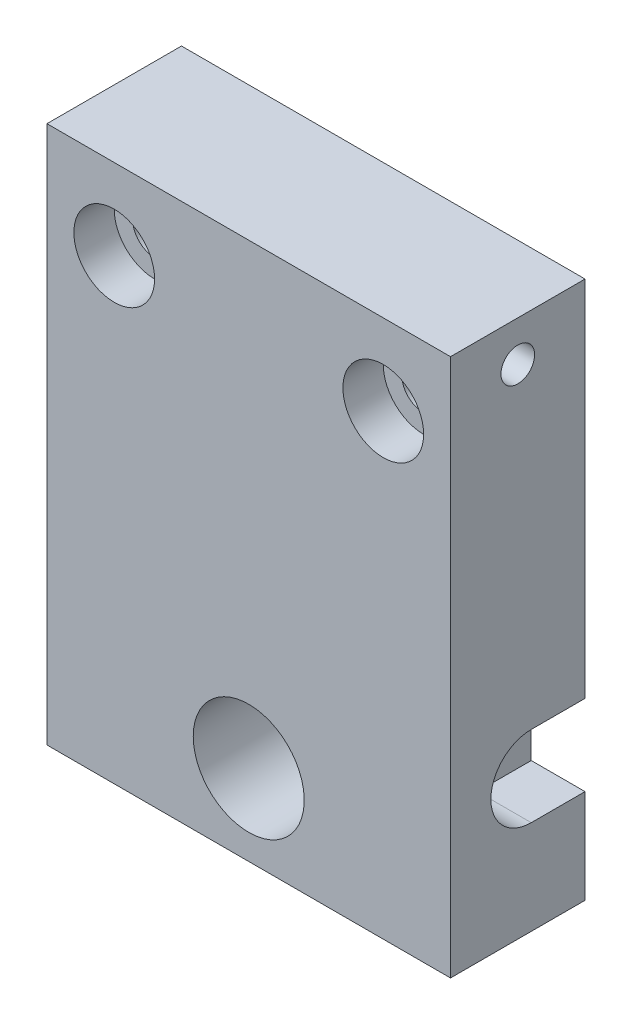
from build123d import *

# Parameters (mm, degrees)
ESQUISSE1_W                             = 60
ESQUISSE1_H                             = 20
EXTRUSION1_DEPTH                        = 80
CHAMBRAGE_POUR_AXES_6_5_MM3_D           = 6.5
CHAMBRAGE_POUR_AXES_6_5_MM3_CBORE_D     = 12
CHAMBRAGE_POUR_AXES_6_5_MM3_CBORE_DEPTH = 6
TROU_TARAUD_M61_D                       = 5
TROU_TARAUD_M61_DEPTH                   = 16
TROU_TARAUD_M61_TIP                     = 1.502151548
TROU_TARAUD_M62_D                       = 5
TROU_TARAUD_M62_DEPTH                   = 16
TROU_TARAUD_M62_TIP                     = 1.502151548
ENL_V_MAT_EXTRU_1_DEPTH                 = 8
TROU_TARAUD_M18X1_51_D                  = 16.5
TROU_TARAUD_M18X1_51_DEPTH              = 43.5
TROU_TARAUD_M18X1_51_TIP                = 4.957100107


with BuildPart() as part:
    # Esquisse1 → Extrusion1 (new body)
    with BuildSketch(Plane(origin=(0, 0, 0), x_dir=(1, 0, 0), z_dir=(0, 1, 0))):
        with Locations((0, 10)):
            Rectangle(ESQUISSE1_W, ESQUISSE1_H)
    extrude(amount=EXTRUSION1_DEPTH)

    # Chambrage pour axes 6.5 mm3 (through all)
    with Locations(Plane.XY):
        with Locations((-20, 68), (20, 68)):
            CounterBoreHole(CHAMBRAGE_POUR_AXES_6_5_MM3_D / 2, CHAMBRAGE_POUR_AXES_6_5_MM3_CBORE_D / 2, CHAMBRAGE_POUR_AXES_6_5_MM3_CBORE_DEPTH)

    # Trou taraud_ M61
    with Locations(Plane(origin=(30, 0, 0), x_dir=(0, 0, -1), z_dir=(1, 0, 0))):
        with Locations((10, 74)):
            Hole(TROU_TARAUD_M61_D / 2, depth=TROU_TARAUD_M61_DEPTH)
            with Locations((0, 0, -(TROU_TARAUD_M61_DEPTH + TROU_TARAUD_M61_TIP / 2))):  # 118° drill point
                Cone(0, TROU_TARAUD_M61_D / 2, TROU_TARAUD_M61_TIP, mode=Mode.SUBTRACT)

    # Trou taraud_ M62
    with Locations(Plane.ZY.offset(30)):
        with Locations((-10, 74)):
            Hole(TROU_TARAUD_M62_D / 2, depth=TROU_TARAUD_M62_DEPTH)
            with Locations((0, 0, -(TROU_TARAUD_M62_DEPTH + TROU_TARAUD_M62_TIP / 2))):  # 118° drill point
                Cone(0, TROU_TARAUD_M62_D / 2, TROU_TARAUD_M62_TIP, mode=Mode.SUBTRACT)

    # Esquisse8 → Enl_v. mat.-Extru.1 (cut)
    with BuildSketch(Plane(origin=(30, 0, 0), x_dir=(0, 0, -1), z_dir=(1, 0, 0))):
        with BuildLine():
            Line((12, 26), (20, 26))
            Line((20, 26), (20, 14))
            Line((20, 14), (12, 14))
            ThreePointArc((12, 14), (6, 20), (12, 26))
        make_face()
    extrude(amount=-ENL_V_MAT_EXTRU_1_DEPTH, mode=Mode.SUBTRACT)

    # Trou taraud_ M18x1.51
    with Locations(Plane(origin=(0, 0, -20), x_dir=(-1, 0, 0), z_dir=(0, 0, -1))):
        with Locations((0, 12)):
            Hole(TROU_TARAUD_M18X1_51_D / 2, depth=TROU_TARAUD_M18X1_51_DEPTH)
            with Locations((0, 0, -(TROU_TARAUD_M18X1_51_DEPTH + TROU_TARAUD_M18X1_51_TIP / 2))):  # 118° drill point
                Cone(0, TROU_TARAUD_M18X1_51_D / 2, TROU_TARAUD_M18X1_51_TIP, mode=Mode.SUBTRACT)


solid = part.part
